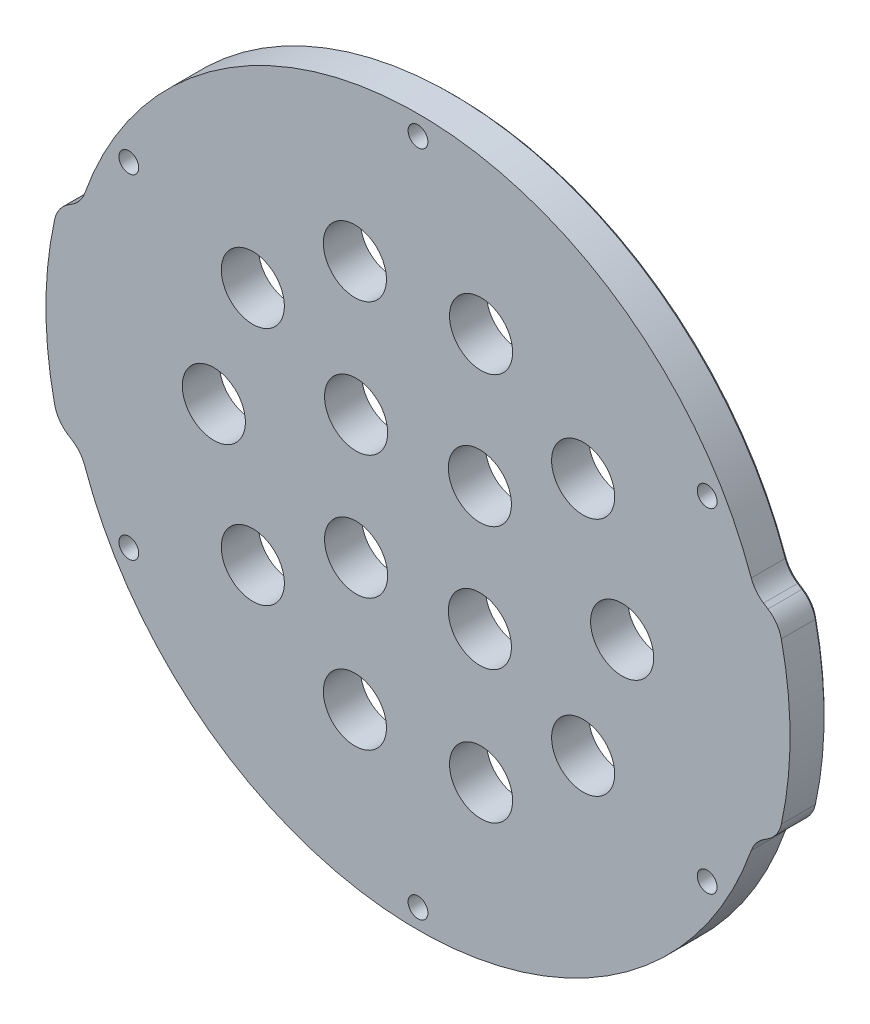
from build123d import *

# Parameters (mm, degrees)
SKETCH1_R           = 1.6
BOSS_EXTRUDE1_DEPTH = 6
FILLET1_R           = 5
CHAMFER1_SIZE       = 0.5
SKETCH9_R           = 5.1
CUT_EXTRUDE1_DEPTH  = 10
CIRPATTERN1_COUNT   = 10
SKETCH10_R          = 5.1
CUT_EXTRUDE2_DEPTH  = 10
CIRPATTERN2_COUNT   = 4


with BuildPart() as part:
    # Sketch1 → Boss-Extrude1 (new body)
    with BuildSketch(Plane.XY):
        with BuildLine():
            Line((54.404710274, 17.5), (58.249656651, 15))
            ThreePointArc((58.249656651, 15), (60.15, 0), (58.249656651, -15))
            Line((58.249656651, -15), (54.404710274, -17.5))
            ThreePointArc((54.404710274, -17.5), (0, -57.15), (-54.404710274, -17.5))
            Line((-54.404710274, -17.5), (-58.249656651, -15))
            ThreePointArc((-58.249656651, -15), (-60.15, 0), (-58.249656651, 15))
            Line((-58.249656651, 15), (-54.404710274, 17.5))
            ThreePointArc((-54.404710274, 17.5), (0, 57.15), (54.404710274, 17.5))
        make_face()
        with Locations((0, 53.975)):
            Circle(SKETCH1_R, mode=Mode.SUBTRACT)
        with Locations((46.743721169, 26.9875)):
            Circle(SKETCH1_R, mode=Mode.SUBTRACT)
        with Locations((46.743721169, -26.9875)):
            Circle(SKETCH1_R, mode=Mode.SUBTRACT)
        with Locations((0, -53.975)):
            Circle(SKETCH1_R, mode=Mode.SUBTRACT)
        with Locations((-46.743721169, -26.9875)):
            Circle(SKETCH1_R, mode=Mode.SUBTRACT)
        with Locations((-46.743721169, 26.9875)):
            Circle(SKETCH1_R, mode=Mode.SUBTRACT)
    extrude(amount=BOSS_EXTRUDE1_DEPTH)

    # Fillet1
    fillet1_edges = [part.edges().sort_by_distance(p)[0] for p in [
        (54.404710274, 17.5, 3),
        (58.249656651, 15, 3),
        (58.249656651, -15, 3),
        (54.404710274, -17.5, 3),
        (-54.404710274, -17.5, 3),
        (-58.249656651, -15, 3),
        (-58.249656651, 15, 3),
        (-54.404710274, 17.5, 3),
    ]]
    fillet(fillet1_edges, radius=FILLET1_R)

    # Chamfer1
    chamfer1_edges = [part.edges().sort_by_distance(p)[0] for p in [
        (60.15, 0, 0),
        (0, 57.15, 0),
        (56.218559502, 16.320627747, 0),
        (56.218559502, -16.320627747, 0),
        (0, -57.15, 0),
        (-56.218559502, -16.320627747, 0),
        (-60.15, 0, 0),
        (-56.218559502, 16.320627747, 0),
        (-57.961950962, 14.742761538, 0),
        (-57.961950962, -14.742761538, 0),
        (57.961950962, 14.742761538, 0),
        (57.961950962, -14.742761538, 0),
        (54.657828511, -17.651398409, 0),
        (54.657828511, 17.651398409, 0),
        (-54.657828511, -17.651398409, 0),
        (-54.657828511, 17.651398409, 0),
    ]]
    chamfer(chamfer1_edges, length=CHAMFER1_SIZE)

    # Sketch9 → Cut-Extrude1 (cut)
    with BuildSketch(Plane.XY.offset(6)):
        with Locations((33, 0)):
            Circle(SKETCH9_R)
    cut_extrude1 = extrude(amount=-CUT_EXTRUDE1_DEPTH, mode=Mode.SUBTRACT)

    # CirPattern1: Cut-Extrude1 ×10 about axis
    cirpattern1_axis = Axis((0, 0, 0), (0, 0, 1))
    for i in range(1, CIRPATTERN1_COUNT):
        add(cut_extrude1.rotate(cirpattern1_axis, i * 360 / CIRPATTERN1_COUNT), mode=Mode.SUBTRACT)

    # Sketch10 → Cut-Extrude2 (cut)
    with BuildSketch(Plane.XY.offset(6)):
        with Locations((-10.005560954, 10.005560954)):
            Circle(SKETCH10_R)
    cut_extrude2 = extrude(amount=-CUT_EXTRUDE2_DEPTH, mode=Mode.SUBTRACT)

    # CirPattern2: Cut-Extrude2 ×4 about axis
    cirpattern2_axis = Axis((0, 0, 0), (0, 0, 1))
    for i in range(1, CIRPATTERN2_COUNT):
        add(cut_extrude2.rotate(cirpattern2_axis, i * 360 / CIRPATTERN2_COUNT), mode=Mode.SUBTRACT)


solid = part.part
